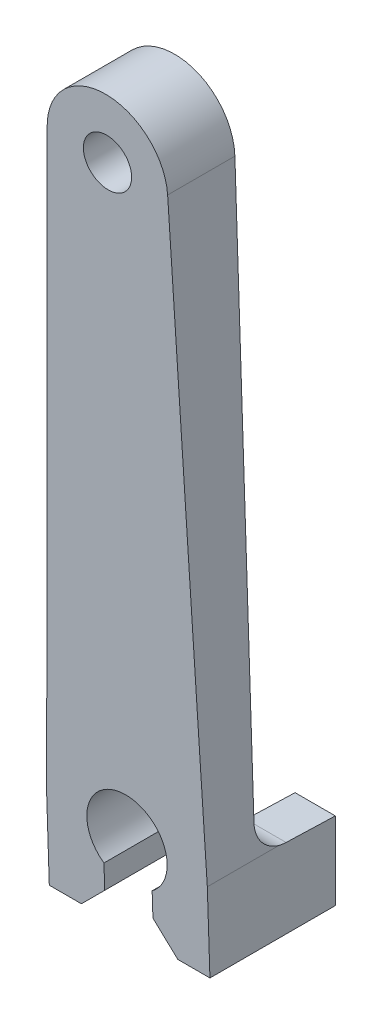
ISO-10303-21;
HEADER;
FILE_DESCRIPTION(('STEP AP214'),'2;1');
FILE_NAME('part.step','',(''),(''),'','','');
FILE_SCHEMA(('AUTOMOTIVE_DESIGN { 1 0 10303 214 1 1 1 1 }'));
ENDSEC;
DATA;
#1=APPLICATION_CONTEXT('core data for automotive mechanical design processes');
#2=APPLICATION_PROTOCOL_DEFINITION('international standard','automotive_design',2000,#1);
#3=PRODUCT_CONTEXT('',#1,'mechanical');
#4=PRODUCT('Part','Part','',(#3));
#5=PRODUCT_RELATED_PRODUCT_CATEGORY('part','',(#4));
#6=PRODUCT_DEFINITION_FORMATION('','',#4);
#7=PRODUCT_DEFINITION_CONTEXT('part definition',#1,'design');
#8=PRODUCT_DEFINITION('design','',#6,#7);
#9=PRODUCT_DEFINITION_SHAPE('','',#8);
#10=(LENGTH_UNIT() NAMED_UNIT(*) SI_UNIT(.MILLI.,.METRE.));
#11=(NAMED_UNIT(*) PLANE_ANGLE_UNIT() SI_UNIT($,.RADIAN.));
#12=(NAMED_UNIT(*) SI_UNIT($,.STERADIAN.) SOLID_ANGLE_UNIT());
#13=UNCERTAINTY_MEASURE_WITH_UNIT(LENGTH_MEASURE(1.E-05),#10,'distance_accuracy_value','');
#14=(GEOMETRIC_REPRESENTATION_CONTEXT(3) GLOBAL_UNCERTAINTY_ASSIGNED_CONTEXT((#13)) GLOBAL_UNIT_ASSIGNED_CONTEXT((#10,
#11,#12)) REPRESENTATION_CONTEXT('',''));
#15=CARTESIAN_POINT('',(0.,0.,0.));
#16=DIRECTION('',(0.,0.,1.));
#17=DIRECTION('',(1.,0.,0.));
#18=AXIS2_PLACEMENT_3D('',#15,#16,#17);
#19=CARTESIAN_POINT('',(0.,0.,0.));
#20=DIRECTION('',(0.,0.,1.));
#21=DIRECTION('',(1.,0.,0.));
#22=AXIS2_PLACEMENT_3D('',#19,#20,#21);
#23=PLANE('',#22);
#24=CARTESIAN_POINT('',(0.,0.,0.));
#25=DIRECTION('',(0.,0.,1.));
#26=DIRECTION('',(1.,0.,0.));
#27=AXIS2_PLACEMENT_3D('',#24,#25,#26);
#28=CIRCLE('',#27,3.);
#29=CARTESIAN_POINT('',(3.,0.,0.));
#30=VERTEX_POINT('',#29);
#31=EDGE_CURVE('E411',#30,#30,#28,.T.);
#32=ORIENTED_EDGE('',*,*,#31,.T.);
#33=EDGE_LOOP('',(#32));
#34=FACE_BOUND('',#33,.T.);
#35=DIRECTION('',(0.0335715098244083,-0.999436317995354,0.));
#36=VECTOR('',#35,1.);
#37=CARTESIAN_POINT('',(7.49577238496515,0.251786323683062,0.));
#38=LINE('',#37,#36);
#39=CARTESIAN_POINT('',(7.49577238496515,0.251786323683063,0.));
#40=VERTEX_POINT('',#39);
#41=CARTESIAN_POINT('',(9.86995344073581,-70.4284656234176,0.));
#42=VERTEX_POINT('',#41);
#43=EDGE_CURVE('E223',#40,#42,#38,.T.);
#44=ORIENTED_EDGE('',*,*,#43,.T.);
#45=DIRECTION('',(1.,0.,0.));
#46=VECTOR('',#45,1.);
#47=CARTESIAN_POINT('',(5.,-70.4284656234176,0.));
#48=LINE('',#47,#46);
#49=CARTESIAN_POINT('',(3.16405144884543,-70.4284656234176,0.));
#50=VERTEX_POINT('',#49);
#51=EDGE_CURVE('E233',#42,#50,#48,.F.);
#52=ORIENTED_EDGE('',*,*,#51,.T.);
#53=CARTESIAN_POINT('',(0.,-74.3,0.));
#54=DIRECTION('',(0.,0.,1.));
#55=DIRECTION('',(1.,0.,0.));
#56=AXIS2_PLACEMENT_3D('',#53,#54,#55);
#57=CIRCLE('',#56,5.);
#58=CARTESIAN_POINT('',(-3.16405144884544,-70.4284656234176,0.));
#59=VERTEX_POINT('',#58);
#60=EDGE_CURVE('E220',#50,#59,#57,.T.);
#61=ORIENTED_EDGE('',*,*,#60,.T.);
#62=DIRECTION('',(1.,0.,0.));
#63=VECTOR('',#62,1.);
#64=CARTESIAN_POINT('',(-10.,-70.4284656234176,0.));
#65=LINE('',#64,#63);
#66=CARTESIAN_POINT('',(-9.8699534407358,-70.4284656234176,0.));
#67=VERTEX_POINT('',#66);
#68=EDGE_CURVE('E231',#59,#67,#65,.F.);
#69=ORIENTED_EDGE('',*,*,#68,.T.);
#70=DIRECTION('',(-0.0335715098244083,-0.999436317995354,0.));
#71=VECTOR('',#70,1.);
#72=CARTESIAN_POINT('',(-7.49577238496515,0.251786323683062,0.));
#73=LINE('',#72,#71);
#74=CARTESIAN_POINT('',(-7.49577238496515,0.251786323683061,0.));
#75=VERTEX_POINT('',#74);
#76=EDGE_CURVE('E406',#75,#67,#73,.T.);
#77=ORIENTED_EDGE('',*,*,#76,.F.);
#78=CARTESIAN_POINT('',(0.,0.,0.));
#79=DIRECTION('',(0.,0.,1.));
#80=DIRECTION('',(1.,0.,0.));
#81=AXIS2_PLACEMENT_3D('',#78,#79,#80);
#82=CIRCLE('',#81,7.5);
#83=EDGE_CURVE('E412',#40,#75,#82,.T.);
#84=ORIENTED_EDGE('',*,*,#83,.F.);
#85=EDGE_LOOP('',(#44,#52,#61,#69,#77,#84));
#86=FACE_BOUND('',#85,.T.);
#87=ADVANCED_FACE('F34',(#34,#86),#23,.F.);
#88=CARTESIAN_POINT('',(0.,-74.3,8.61));
#89=DIRECTION('',(0.,0.,-1.));
#90=DIRECTION('',(-1.,0.,0.));
#91=AXIS2_PLACEMENT_3D('',#88,#89,#90);
#92=CYLINDRICAL_SURFACE('',#91,5.);
#93=CARTESIAN_POINT('',(0.,-74.3,3.08780778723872E-13));
#94=DIRECTION('',(0.,-0.9994674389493,0.0326318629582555));
#95=DIRECTION('',(0.,-0.0326318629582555,-0.9994674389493));
#96=AXIS2_PLACEMENT_3D('',#93,#94,#95);
#97=ELLIPSE('',#96,153.224472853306,5.);
#98=CARTESIAN_POINT('',(4.9893288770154,-74.626492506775,-10.));
#99=VERTEX_POINT('',#98);
#100=CARTESIAN_POINT('',(4.99840368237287,-74.4263353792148,-3.86947254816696));
#101=VERTEX_POINT('',#100);
#102=EDGE_CURVE('E238',#99,#101,#97,.T.);
#103=ORIENTED_EDGE('',*,*,#102,.F.);
#104=CARTESIAN_POINT('',(0.,-74.3,-10.));
#105=DIRECTION('',(0.,0.,1.));
#106=DIRECTION('',(-1.,0.,0.));
#107=AXIS2_PLACEMENT_3D('',#104,#105,#106);
#108=CIRCLE('',#107,5.);
#109=CARTESIAN_POINT('',(3.,-78.3,-10.));
#110=VERTEX_POINT('',#109);
#111=EDGE_CURVE('E254',#110,#99,#108,.T.);
#112=ORIENTED_EDGE('',*,*,#111,.F.);
#113=DIRECTION('',(0.,0.,-1.));
#114=VECTOR('',#113,1.);
#115=CARTESIAN_POINT('',(3.,-78.3,8.61));
#116=LINE('',#115,#114);
#117=CARTESIAN_POINT('',(3.,-78.3,5.80607843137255));
#118=VERTEX_POINT('',#117);
#119=EDGE_CURVE('E289',#118,#110,#116,.T.);
#120=ORIENTED_EDGE('',*,*,#119,.F.);
#121=CARTESIAN_POINT('',(0.,-74.3,5.93679738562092));
#122=DIRECTION('',(0.,-0.0326623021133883,0.999466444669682));
#123=DIRECTION('',(0.,-0.999466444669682,-0.0326623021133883));
#124=AXIS2_PLACEMENT_3D('',#121,#122,#123);
#125=ELLIPSE('',#124,5.00266920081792,5.);
#126=CARTESIAN_POINT('',(-3.,-78.3,5.80607843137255));
#127=VERTEX_POINT('',#126);
#128=EDGE_CURVE('E202',#118,#127,#125,.T.);
#129=ORIENTED_EDGE('',*,*,#128,.T.);
#130=DIRECTION('',(0.,0.,-1.));
#131=VECTOR('',#130,1.);
#132=CARTESIAN_POINT('',(-3.,-78.3,8.61));
#133=LINE('',#132,#131);
#134=CARTESIAN_POINT('',(-3.,-78.3,-10.));
#135=VERTEX_POINT('',#134);
#136=EDGE_CURVE('E415',#127,#135,#133,.T.);
#137=ORIENTED_EDGE('',*,*,#136,.T.);
#138=CARTESIAN_POINT('',(0.,-74.3,-10.));
#139=DIRECTION('',(0.,0.,1.));
#140=DIRECTION('',(-1.,0.,0.));
#141=AXIS2_PLACEMENT_3D('',#138,#139,#140);
#142=CIRCLE('',#141,5.);
#143=CARTESIAN_POINT('',(-4.9893288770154,-74.626492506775,-10.));
#144=VERTEX_POINT('',#143);
#145=EDGE_CURVE('E257',#144,#135,#142,.T.);
#146=ORIENTED_EDGE('',*,*,#145,.F.);
#147=CARTESIAN_POINT('',(-4.99840368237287,-74.4263353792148,-3.86947254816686));
#148=VERTEX_POINT('',#147);
#149=EDGE_CURVE('E170',#148,#144,#97,.T.);
#150=ORIENTED_EDGE('',*,*,#149,.F.);
#151=CARTESIAN_POINT('',(-4.99840368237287,-74.4263353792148,-3.86947254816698));
#152=CARTESIAN_POINT('',(-4.99846816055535,-74.4226998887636,-3.75776325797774));
#153=CARTESIAN_POINT('',(-4.99870159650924,-74.4143594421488,-3.64620977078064));
#154=CARTESIAN_POINT('',(-4.99924305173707,-74.3883789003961,-3.4241937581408));
#155=CARTESIAN_POINT('',(-4.99955106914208,-74.3707390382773,-3.31373120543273));
#156=CARTESIAN_POINT('',(-4.99997860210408,-74.326247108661,-3.09455927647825));
#157=CARTESIAN_POINT('',(-5.00009792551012,-74.2993856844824,-2.98585179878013));
#158=CARTESIAN_POINT('',(-4.99969748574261,-74.2366476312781,-2.77107187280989));
#159=CARTESIAN_POINT('',(-4.99917772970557,-74.2007711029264,-2.66499939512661));
#160=CARTESIAN_POINT('',(-4.99692942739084,-74.1202276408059,-2.45616465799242));
#161=CARTESIAN_POINT('',(-4.99519996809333,-74.0755540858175,-2.35340496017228));
#162=CARTESIAN_POINT('',(-4.98984498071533,-73.9777491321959,-2.15199485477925));
#163=CARTESIAN_POINT('',(-4.98621878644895,-73.9246147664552,-2.0533459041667));
#164=CARTESIAN_POINT('',(-4.97629817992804,-73.810367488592,-1.86101897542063));
#165=CARTESIAN_POINT('',(-4.9700058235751,-73.7492607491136,-1.76733722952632));
#166=CARTESIAN_POINT('',(-4.95391705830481,-73.6195793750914,-1.58561609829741));
#167=CARTESIAN_POINT('',(-4.94412100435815,-73.5510054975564,-1.49757614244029));
#168=CARTESIAN_POINT('',(-4.92049785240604,-73.4090862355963,-1.33024425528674));
#169=CARTESIAN_POINT('',(-4.90679151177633,-73.3359286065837,-1.25077622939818));
#170=CARTESIAN_POINT('',(-4.87448365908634,-73.1840098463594,-1.09852917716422));
#171=CARTESIAN_POINT('',(-4.85588445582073,-73.1052513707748,-1.0257470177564));
#172=CARTESIAN_POINT('',(-4.81308973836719,-72.9430946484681,-0.887446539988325));
#173=CARTESIAN_POINT('',(-4.78889760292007,-72.8596992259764,-0.821923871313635));
#174=CARTESIAN_POINT('',(-4.73431672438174,-72.6893355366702,-0.698557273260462));
#175=CARTESIAN_POINT('',(-4.70392865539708,-72.6023676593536,-0.64071250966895));
#176=CARTESIAN_POINT('',(-4.63983047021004,-72.4347332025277,-0.538269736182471));
#177=CARTESIAN_POINT('',(-4.60673679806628,-72.3542832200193,-0.492929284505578));
#178=CARTESIAN_POINT('',(-4.53498069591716,-72.1924463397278,-0.408804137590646));
#179=CARTESIAN_POINT('',(-4.49631846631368,-72.1110594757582,-0.370019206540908));
#180=CARTESIAN_POINT('',(-4.41337773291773,-71.9483113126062,-0.298924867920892));
#181=CARTESIAN_POINT('',(-4.36909858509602,-71.8669500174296,-0.266616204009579));
#182=CARTESIAN_POINT('',(-4.27501273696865,-71.7051936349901,-0.208251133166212));
#183=CARTESIAN_POINT('',(-4.2252060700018,-71.6247985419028,-0.182194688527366));
#184=CARTESIAN_POINT('',(-4.1217748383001,-71.4681226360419,-0.136636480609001));
#185=CARTESIAN_POINT('',(-4.06830189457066,-71.3917900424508,-0.11696728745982));
#186=CARTESIAN_POINT('',(-3.95655113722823,-71.2414911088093,-0.0827390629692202));
#187=CARTESIAN_POINT('',(-3.89827130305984,-71.1675257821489,-0.068182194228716));
#188=CARTESIAN_POINT('',(-3.77725912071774,-71.0226198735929,-0.0436913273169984));
#189=CARTESIAN_POINT('',(-3.71452946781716,-70.9516775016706,-0.0337545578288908));
#190=CARTESIAN_POINT('',(-3.58489626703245,-70.8132377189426,-0.0179396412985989));
#191=CARTESIAN_POINT('',(-3.51799261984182,-70.7457403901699,-0.0120615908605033));
#192=CARTESIAN_POINT('',(-3.40324797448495,-70.6364048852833,-0.00516776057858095));
#193=CARTESIAN_POINT('',(-3.35647042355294,-70.5935011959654,-0.00318493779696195));
#194=CARTESIAN_POINT('',(-3.26139806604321,-70.5095783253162,-0.000602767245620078));
#195=CARTESIAN_POINT('',(-3.2131067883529,-70.4685552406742,-4.13750689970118E-07));
#196=CARTESIAN_POINT('',(-3.16405144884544,-70.4284656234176,0.));
#197=B_SPLINE_CURVE_WITH_KNOTS('',3,(#151,#152,#153,#154,#155,#156,#157,#158,#159,#160,#161,
#162,#163,#164,#165,#166,#167,#168,#169,#170,#171,#172,#173,#174,#175,#176,#177,#178,#179,#180,
#181,#182,#183,#184,#185,#186,#187,#188,#189,#190,#191,#192,#193,#194,#195,#196),.UNSPECIFIED.,
.F.,.F.,(4,2,2,2,2,2,2,2,2,2,2,2,2,2,2,2,2,2,2,2,2,2,4),(0.,0.335203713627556,0.670399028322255,
1.0059354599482,1.34146814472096,1.67725434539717,2.01315856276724,2.34880423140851,
2.68441590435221,3.01061520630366,3.33666085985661,3.66251005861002,3.98832382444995,
4.28224169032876,4.57614898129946,4.87009000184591,5.16402924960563,5.44948749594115,
5.73506635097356,6.02047368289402,6.3058878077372,6.49634383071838,6.6863847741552),.UNSPECIFIED.);
#198=EDGE_CURVE('E319',#148,#59,#197,.T.);
#199=ORIENTED_EDGE('',*,*,#198,.T.);
#200=ORIENTED_EDGE('',*,*,#60,.F.);
#201=CARTESIAN_POINT('',(3.16405144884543,-70.4284656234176,0.));
#202=CARTESIAN_POINT('',(3.24727599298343,-70.4964618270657,1.80483169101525E-07));
#203=CARTESIAN_POINT('',(3.32831397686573,-70.5671851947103,-0.00173421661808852));
#204=CARTESIAN_POINT('',(3.4856284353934,-70.7136489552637,-0.00950453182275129));
#205=CARTESIAN_POINT('',(3.56190067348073,-70.7893936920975,-0.01554421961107));
#206=CARTESIAN_POINT('',(3.70949562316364,-70.9457103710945,-0.0328010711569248));
#207=CARTESIAN_POINT('',(3.78079324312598,-71.0263034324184,-0.0440425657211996));
#208=CARTESIAN_POINT('',(3.91755588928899,-71.1912659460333,-0.0725150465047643));
#209=CARTESIAN_POINT('',(3.98302258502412,-71.2756343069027,-0.0897443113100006));
#210=CARTESIAN_POINT('',(4.10813115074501,-71.4478674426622,-0.131058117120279));
#211=CARTESIAN_POINT('',(4.16773201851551,-71.5357515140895,-0.155186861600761));
#212=CARTESIAN_POINT('',(4.28026311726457,-71.7134188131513,-0.210863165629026));
#213=CARTESIAN_POINT('',(4.33319409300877,-71.8032018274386,-0.242409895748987));
#214=CARTESIAN_POINT('',(4.4320226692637,-71.9831742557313,-0.313239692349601));
#215=CARTESIAN_POINT('',(4.47794217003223,-72.0733614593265,-0.352497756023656));
#216=CARTESIAN_POINT('',(4.5629125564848,-72.2531217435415,-0.439020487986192));
#217=CARTESIAN_POINT('',(4.60196429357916,-72.3426948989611,-0.486284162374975));
#218=CARTESIAN_POINT('',(4.66951777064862,-72.5103429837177,-0.583257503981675));
#219=CARTESIAN_POINT('',(4.69870323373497,-72.5886155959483,-0.632152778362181));
#220=CARTESIAN_POINT('',(4.75201577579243,-72.7427592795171,-0.736154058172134));
#221=CARTESIAN_POINT('',(4.77614123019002,-72.8186295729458,-0.791262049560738));
#222=CARTESIAN_POINT('',(4.81970289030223,-72.9671608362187,-0.907440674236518));
#223=CARTESIAN_POINT('',(4.83913588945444,-73.039819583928,-0.968515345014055));
#224=CARTESIAN_POINT('',(4.87375703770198,-73.1811657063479,-1.09625726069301));
#225=CARTESIAN_POINT('',(4.88894352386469,-73.2498515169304,-1.16292668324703));
#226=CARTESIAN_POINT('',(4.91549926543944,-73.3821795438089,-1.3009896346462));
#227=CARTESIAN_POINT('',(4.92689167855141,-73.4458504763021,-1.37235119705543));
#228=CARTESIAN_POINT('',(4.94653189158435,-73.5681145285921,-1.51972013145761));
#229=CARTESIAN_POINT('',(4.95477857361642,-73.6267058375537,-1.59572914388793));
#230=CARTESIAN_POINT('',(4.97562120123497,-73.7941668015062,-1.83001676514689));
#231=CARTESIAN_POINT('',(4.98433512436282,-73.8948082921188,-1.99464433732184));
#232=CARTESIAN_POINT('',(4.99609939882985,-74.0798847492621,-2.35325688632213));
#233=CARTESIAN_POINT('',(4.99852226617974,-74.161819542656,-2.54854186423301));
#234=CARTESIAN_POINT('',(5.00043567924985,-74.2938200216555,-2.94953246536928));
#235=CARTESIAN_POINT('',(4.99992878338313,-74.3439134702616,-3.15522884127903));
#236=CARTESIAN_POINT('',(4.99918661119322,-74.3909943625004,-3.44718414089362));
#237=CARTESIAN_POINT('',(4.99896994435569,-74.4018302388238,-3.53139581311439));
#238=CARTESIAN_POINT('',(4.99861104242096,-74.4181116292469,-3.70018898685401));
#239=CARTESIAN_POINT('',(4.99846867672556,-74.4235666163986,-3.78476957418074));
#240=CARTESIAN_POINT('',(4.99840368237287,-74.4263353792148,-3.86947254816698));
#241=B_SPLINE_CURVE_WITH_KNOTS('',3,(#201,#202,#203,#204,#205,#206,#207,#208,#209,#210,#211,
#212,#213,#214,#215,#216,#217,#218,#219,#220,#221,#222,#223,#224,#225,#226,#227,#228,#229,#230,
#231,#232,#233,#234,#235,#236,#237,#238,#239,#240),.UNSPECIFIED.,.F.,.F.,(4,2,2,2,2,2,2,2,2,2,2,
2,2,2,2,2,2,2,2,4),(0.,0.322388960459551,0.64506054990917,0.969256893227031,1.29336011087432,
1.61958818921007,1.94577980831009,2.27093075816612,2.59604136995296,2.88606722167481,
3.17618604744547,3.46650256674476,3.75693261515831,4.04555602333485,4.33428190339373,
4.91136730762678,5.54412598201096,6.17633218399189,6.43091409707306,6.68504701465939),.UNSPECIFIED.);
#242=EDGE_CURVE('E317',#50,#101,#241,.T.);
#243=ORIENTED_EDGE('',*,*,#242,.T.);
#244=EDGE_LOOP('',(#103,#112,#120,#129,#137,#146,#150,#199,#200,#243));
#245=FACE_BOUND('',#244,.T.);
#246=ADVANCED_FACE('F315',(#245),#92,.F.);
#247=CARTESIAN_POINT('',(2.99999999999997,0.,8.61));
#248=DIRECTION('',(1.,0.,0.));
#249=DIRECTION('',(0.,1.,0.));
#250=AXIS2_PLACEMENT_3D('',#247,#248,#249);
#251=PLANE('',#250);
#252=DIRECTION('',(0.,-0.999466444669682,-0.0326623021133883));
#253=VECTOR('',#252,1.);
#254=CARTESIAN_POINT('',(2.99999999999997,0.00800119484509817,8.36516343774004));
#255=LINE('',#254,#253);
#256=CARTESIAN_POINT('',(3.,-81.3,5.70803921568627));
#257=VERTEX_POINT('',#256);
#258=EDGE_CURVE('E205',#118,#257,#255,.T.);
#259=ORIENTED_EDGE('',*,*,#258,.F.);
#260=ORIENTED_EDGE('',*,*,#119,.T.);
#261=DIRECTION('',(0.,1.,0.));
#262=VECTOR('',#261,1.);
#263=CARTESIAN_POINT('',(3.,-78.3,-10.));
#264=LINE('',#263,#262);
#265=CARTESIAN_POINT('',(3.,-81.3,-10.));
#266=VERTEX_POINT('',#265);
#267=EDGE_CURVE('E251',#266,#110,#264,.T.);
#268=ORIENTED_EDGE('',*,*,#267,.F.);
#269=DIRECTION('',(0.,0.,-1.));
#270=VECTOR('',#269,1.);
#271=CARTESIAN_POINT('',(3.,-81.3,8.61));
#272=LINE('',#271,#270);
#273=EDGE_CURVE('E287',#257,#266,#272,.T.);
#274=ORIENTED_EDGE('',*,*,#273,.F.);
#275=EDGE_LOOP('',(#259,#260,#268,#274));
#276=FACE_BOUND('',#275,.T.);
#277=ADVANCED_FACE('F336',(#276),#251,.F.);
#278=CARTESIAN_POINT('',(-39.15,-39.15,8.61));
#279=DIRECTION('',(0.707106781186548,0.707106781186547,0.));
#280=DIRECTION('',(-0.707106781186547,0.707106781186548,0.));
#281=AXIS2_PLACEMENT_3D('',#278,#279,#280);
#282=PLANE('',#281);
#283=DIRECTION('',(0.706918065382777,-0.706918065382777,-0.0231018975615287));
#284=VECTOR('',#283,1.);
#285=CARTESIAN_POINT('',(-39.1748969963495,-39.1251030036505,7.08630382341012));
#286=LINE('',#285,#284);
#287=CARTESIAN_POINT('',(6.,-84.3,5.61));
#288=VERTEX_POINT('',#287);
#289=EDGE_CURVE('E207',#257,#288,#286,.T.);
#290=ORIENTED_EDGE('',*,*,#289,.F.);
#291=ORIENTED_EDGE('',*,*,#273,.T.);
#292=DIRECTION('',(-0.707106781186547,0.707106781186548,0.));
#293=VECTOR('',#292,1.);
#294=CARTESIAN_POINT('',(3.,-81.3,-10.));
#295=LINE('',#294,#293);
#296=CARTESIAN_POINT('',(6.,-84.3,-10.));
#297=VERTEX_POINT('',#296);
#298=EDGE_CURVE('E248',#297,#266,#295,.T.);
#299=ORIENTED_EDGE('',*,*,#298,.F.);
#300=DIRECTION('',(0.,0.,-1.));
#301=VECTOR('',#300,1.);
#302=CARTESIAN_POINT('',(6.,-84.3,8.61));
#303=LINE('',#302,#301);
#304=EDGE_CURVE('E285',#288,#297,#303,.T.);
#305=ORIENTED_EDGE('',*,*,#304,.F.);
#306=EDGE_LOOP('',(#290,#291,#299,#305));
#307=FACE_BOUND('',#306,.T.);
#308=ADVANCED_FACE('F340',(#307),#282,.F.);
#309=CARTESIAN_POINT('',(0.,-84.3,8.61));
#310=DIRECTION('',(0.,1.,0.));
#311=DIRECTION('',(0.,0.,1.));
#312=AXIS2_PLACEMENT_3D('',#309,#310,#311);
#313=PLANE('',#312);
#314=DIRECTION('',(1.,0.,0.));
#315=VECTOR('',#314,1.);
#316=CARTESIAN_POINT('',(-19.805,-84.3,5.61));
#317=LINE('',#316,#315);
#318=CARTESIAN_POINT('',(10.,-84.3,5.61));
#319=VERTEX_POINT('',#318);
#320=EDGE_CURVE('E185',#288,#319,#317,.T.);
#321=ORIENTED_EDGE('',*,*,#320,.F.);
#322=ORIENTED_EDGE('',*,*,#304,.T.);
#323=DIRECTION('',(-1.,0.,0.));
#324=VECTOR('',#323,1.);
#325=CARTESIAN_POINT('',(6.,-84.3,-10.));
#326=LINE('',#325,#324);
#327=CARTESIAN_POINT('',(10.,-84.3,-10.));
#328=VERTEX_POINT('',#327);
#329=EDGE_CURVE('E245',#328,#297,#326,.T.);
#330=ORIENTED_EDGE('',*,*,#329,.F.);
#331=DIRECTION('',(0.,0.,-1.));
#332=VECTOR('',#331,1.);
#333=CARTESIAN_POINT('',(10.,-84.3,8.61));
#334=LINE('',#333,#332);
#335=EDGE_CURVE('E282',#319,#328,#334,.T.);
#336=ORIENTED_EDGE('',*,*,#335,.F.);
#337=EDGE_LOOP('',(#321,#322,#330,#336));
#338=FACE_BOUND('',#337,.T.);
#339=ADVANCED_FACE('F344',(#338),#313,.F.);
#340=CARTESIAN_POINT('',(9.99999999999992,0.,8.61));
#341=DIRECTION('',(1.,0.,0.));
#342=DIRECTION('',(0.,1.,0.));
#343=AXIS2_PLACEMENT_3D('',#340,#341,#342);
#344=PLANE('',#343);
#345=DIRECTION('',(0.,-0.0326318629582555,-0.9994674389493));
#346=VECTOR('',#345,1.);
#347=CARTESIAN_POINT('',(10.,-74.3,0.));
#348=LINE('',#347,#346);
#349=CARTESIAN_POINT('',(10.,-74.4263353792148,-3.86947254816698));
#350=VERTEX_POINT('',#349);
#351=CARTESIAN_POINT('',(10.,-74.626492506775,-10.));
#352=VERTEX_POINT('',#351);
#353=EDGE_CURVE('E178',#350,#352,#348,.T.);
#354=ORIENTED_EDGE('',*,*,#353,.F.);
#355=CARTESIAN_POINT('',(9.99999999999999,-70.4284656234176,-4.));
#356=DIRECTION('',(1.,0.,0.));
#357=DIRECTION('',(0.,1.,0.));
#358=AXIS2_PLACEMENT_3D('',#355,#356,#357);
#359=CIRCLE('',#358,4.);
#360=CARTESIAN_POINT('',(10.,-74.3,-2.99440486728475));
#361=VERTEX_POINT('',#360);
#362=EDGE_CURVE('E303',#350,#361,#359,.F.);
#363=ORIENTED_EDGE('',*,*,#362,.T.);
#364=DIRECTION('',(0.,0.,-1.));
#365=VECTOR('',#364,1.);
#366=CARTESIAN_POINT('',(10.,-74.3,8.61));
#367=LINE('',#366,#365);
#368=CARTESIAN_POINT('',(10.,-74.3,5.93679738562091));
#369=VERTEX_POINT('',#368);
#370=EDGE_CURVE('E57',#369,#361,#367,.T.);
#371=ORIENTED_EDGE('',*,*,#370,.F.);
#372=DIRECTION('',(0.,-0.999466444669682,-0.0326623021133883));
#373=VECTOR('',#372,1.);
#374=CARTESIAN_POINT('',(9.99999999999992,0.00800119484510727,8.36516343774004));
#375=LINE('',#374,#373);
#376=EDGE_CURVE('E217',#369,#319,#375,.T.);
#377=ORIENTED_EDGE('',*,*,#376,.T.);
#378=ORIENTED_EDGE('',*,*,#335,.T.);
#379=DIRECTION('',(0.,-1.,0.));
#380=VECTOR('',#379,1.);
#381=CARTESIAN_POINT('',(10.,-74.3,-10.));
#382=LINE('',#381,#380);
#383=EDGE_CURVE('E243',#352,#328,#382,.T.);
#384=ORIENTED_EDGE('',*,*,#383,.F.);
#385=EDGE_LOOP('',(#354,#363,#371,#377,#378,#384));
#386=FACE_BOUND('',#385,.T.);
#387=ADVANCED_FACE('F302',(#386),#344,.T.);
#388=CARTESIAN_POINT('',(7.49577238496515,0.251786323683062,8.61));
#389=DIRECTION('',(0.999436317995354,0.0335715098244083,0.));
#390=DIRECTION('',(-0.0335715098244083,0.999436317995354,0.));
#391=AXIS2_PLACEMENT_3D('',#388,#389,#390);
#392=PLANE('',#391);
#393=DIRECTION('',(0.,0.,-1.));
#394=VECTOR('',#393,1.);
#395=CARTESIAN_POINT('',(7.49577238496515,0.251786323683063,8.61));
#396=LINE('',#395,#394);
#397=CARTESIAN_POINT('',(7.49577238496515,0.251786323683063,8.37313027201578));
#398=VERTEX_POINT('',#397);
#399=EDGE_CURVE('E279',#398,#40,#396,.T.);
#400=ORIENTED_EDGE('',*,*,#399,.F.);
#401=DIRECTION('',(0.0335536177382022,-0.998903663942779,-0.0326439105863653));
#402=VECTOR('',#401,1.);
#403=CARTESIAN_POINT('',(7.49551293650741,0.259510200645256,8.3733826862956));
#404=LINE('',#403,#402);
#405=EDGE_CURVE('E215',#398,#369,#404,.T.);
#406=ORIENTED_EDGE('',*,*,#405,.T.);
#407=ORIENTED_EDGE('',*,*,#370,.T.);
#408=CARTESIAN_POINT('',(9.8699534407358,-70.4284656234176,-4.));
#409=DIRECTION('',(0.999436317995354,0.0335715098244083,0.));
#410=DIRECTION('',(-0.0335715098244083,0.999436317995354,0.));
#411=AXIS2_PLACEMENT_3D('',#408,#409,#410);
#412=ELLIPSE('',#411,4.00225599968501,4.);
#413=EDGE_CURVE('E320',#361,#42,#412,.F.);
#414=ORIENTED_EDGE('',*,*,#413,.T.);
#415=ORIENTED_EDGE('',*,*,#43,.F.);
#416=EDGE_LOOP('',(#400,#406,#407,#414,#415));
#417=FACE_BOUND('',#416,.T.);
#418=ADVANCED_FACE('F351',(#417),#392,.T.);
#419=CARTESIAN_POINT('',(0.,0.,8.61));
#420=DIRECTION('',(0.,0.,-1.));
#421=DIRECTION('',(-1.,0.,0.));
#422=AXIS2_PLACEMENT_3D('',#419,#420,#421);
#423=CYLINDRICAL_SURFACE('',#422,7.5);
#424=CARTESIAN_POINT('',(0.,0.,8.36490196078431));
#425=DIRECTION('',(0.,-0.0326623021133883,0.999466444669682));
#426=DIRECTION('',(0.,-0.999466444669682,-0.0326623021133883));
#427=AXIS2_PLACEMENT_3D('',#424,#425,#426);
#428=ELLIPSE('',#427,7.50400380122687,7.5);
#429=CARTESIAN_POINT('',(-7.49577238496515,0.251786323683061,8.37313027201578));
#430=VERTEX_POINT('',#429);
#431=EDGE_CURVE('E213',#398,#430,#428,.T.);
#432=ORIENTED_EDGE('',*,*,#431,.F.);
#433=ORIENTED_EDGE('',*,*,#399,.T.);
#434=ORIENTED_EDGE('',*,*,#83,.T.);
#435=DIRECTION('',(0.,0.,-1.));
#436=VECTOR('',#435,1.);
#437=CARTESIAN_POINT('',(-7.49577238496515,0.251786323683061,8.61));
#438=LINE('',#437,#436);
#439=EDGE_CURVE('E272',#430,#75,#438,.T.);
#440=ORIENTED_EDGE('',*,*,#439,.F.);
#441=EDGE_LOOP('',(#432,#433,#434,#440));
#442=FACE_BOUND('',#441,.T.);
#443=ADVANCED_FACE('F354',(#442),#423,.T.);
#444=CARTESIAN_POINT('',(-7.49577238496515,0.251786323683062,8.61));
#445=DIRECTION('',(0.999436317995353,-0.0335715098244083,0.));
#446=DIRECTION('',(0.0335715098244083,0.999436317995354,0.));
#447=AXIS2_PLACEMENT_3D('',#444,#445,#446);
#448=PLANE('',#447);
#449=DIRECTION('',(-0.0335536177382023,-0.998903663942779,-0.0326439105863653));
#450=VECTOR('',#449,1.);
#451=CARTESIAN_POINT('',(-7.4955129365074,0.259510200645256,8.3733826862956));
#452=LINE('',#451,#450);
#453=CARTESIAN_POINT('',(-10.,-74.3,5.93679738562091));
#454=VERTEX_POINT('',#453);
#455=EDGE_CURVE('E211',#430,#454,#452,.T.);
#456=ORIENTED_EDGE('',*,*,#455,.F.);
#457=ORIENTED_EDGE('',*,*,#439,.T.);
#458=ORIENTED_EDGE('',*,*,#76,.T.);
#459=CARTESIAN_POINT('',(-9.86995344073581,-70.4284656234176,-4.));
#460=DIRECTION('',(0.999436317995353,-0.0335715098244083,0.));
#461=DIRECTION('',(-0.0335715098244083,-0.999436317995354,0.));
#462=AXIS2_PLACEMENT_3D('',#459,#460,#461);
#463=ELLIPSE('',#462,4.00225599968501,4.);
#464=CARTESIAN_POINT('',(-10.,-74.3,-2.99440486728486));
#465=VERTEX_POINT('',#464);
#466=EDGE_CURVE('E43',#67,#465,#463,.T.);
#467=ORIENTED_EDGE('',*,*,#466,.T.);
#468=DIRECTION('',(0.,0.,-1.));
#469=VECTOR('',#468,1.);
#470=CARTESIAN_POINT('',(-10.,-74.3,8.61));
#471=LINE('',#470,#469);
#472=EDGE_CURVE('E49',#454,#465,#471,.T.);
#473=ORIENTED_EDGE('',*,*,#472,.F.);
#474=EDGE_LOOP('',(#456,#457,#458,#467,#473));
#475=FACE_BOUND('',#474,.T.);
#476=ADVANCED_FACE('F357',(#475),#448,.F.);
#477=CARTESIAN_POINT('',(-10.0000000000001,0.,8.61));
#478=DIRECTION('',(1.,0.,0.));
#479=DIRECTION('',(0.,1.,0.));
#480=AXIS2_PLACEMENT_3D('',#477,#478,#479);
#481=PLANE('',#480);
#482=ORIENTED_EDGE('',*,*,#472,.T.);
#483=CARTESIAN_POINT('',(-10.,-70.4284656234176,-4.));
#484=DIRECTION('',(1.,0.,0.));
#485=DIRECTION('',(0.,1.,0.));
#486=AXIS2_PLACEMENT_3D('',#483,#484,#485);
#487=CIRCLE('',#486,4.);
#488=CARTESIAN_POINT('',(-10.,-74.4263353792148,-3.86947254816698));
#489=VERTEX_POINT('',#488);
#490=EDGE_CURVE('E11',#465,#489,#487,.T.);
#491=ORIENTED_EDGE('',*,*,#490,.T.);
#492=DIRECTION('',(0.,-0.0326318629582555,-0.9994674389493));
#493=VECTOR('',#492,1.);
#494=CARTESIAN_POINT('',(-10.,-73.9400717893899,11.0240879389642));
#495=LINE('',#494,#493);
#496=CARTESIAN_POINT('',(-10.,-74.626492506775,-10.));
#497=VERTEX_POINT('',#496);
#498=EDGE_CURVE('E160',#489,#497,#495,.T.);
#499=ORIENTED_EDGE('',*,*,#498,.T.);
#500=DIRECTION('',(0.,1.,0.));
#501=VECTOR('',#500,1.);
#502=CARTESIAN_POINT('',(-10.,-74.3,-10.));
#503=LINE('',#502,#501);
#504=CARTESIAN_POINT('',(-9.99999999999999,-84.3,-10.));
#505=VERTEX_POINT('',#504);
#506=EDGE_CURVE('E165',#505,#497,#503,.T.);
#507=ORIENTED_EDGE('',*,*,#506,.F.);
#508=DIRECTION('',(0.,0.,-1.));
#509=VECTOR('',#508,1.);
#510=CARTESIAN_POINT('',(-9.99999999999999,-84.3,8.61));
#511=LINE('',#510,#509);
#512=CARTESIAN_POINT('',(-9.99999999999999,-84.3,5.61));
#513=VERTEX_POINT('',#512);
#514=EDGE_CURVE('E270',#513,#505,#511,.T.);
#515=ORIENTED_EDGE('',*,*,#514,.F.);
#516=DIRECTION('',(0.,-0.999466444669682,-0.0326623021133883));
#517=VECTOR('',#516,1.);
#518=CARTESIAN_POINT('',(-10.0000000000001,0.00800119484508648,8.36516343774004));
#519=LINE('',#518,#517);
#520=EDGE_CURVE('E209',#454,#513,#519,.T.);
#521=ORIENTED_EDGE('',*,*,#520,.F.);
#522=EDGE_LOOP('',(#482,#491,#499,#507,#515,#521));
#523=FACE_BOUND('',#522,.T.);
#524=ADVANCED_FACE('F162',(#523),#481,.F.);
#525=CARTESIAN_POINT('',(0.,-84.3,8.61));
#526=DIRECTION('',(0.,1.,0.));
#527=DIRECTION('',(0.,0.,1.));
#528=AXIS2_PLACEMENT_3D('',#525,#526,#527);
#529=PLANE('',#528);
#530=CARTESIAN_POINT('',(-5.99999999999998,-84.3,5.61));
#531=VERTEX_POINT('',#530);
#532=EDGE_CURVE('E187',#513,#531,#317,.T.);
#533=ORIENTED_EDGE('',*,*,#532,.F.);
#534=ORIENTED_EDGE('',*,*,#514,.T.);
#535=DIRECTION('',(-1.,0.,0.));
#536=VECTOR('',#535,1.);
#537=CARTESIAN_POINT('',(-9.99999999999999,-84.3,-10.));
#538=LINE('',#537,#536);
#539=CARTESIAN_POINT('',(-6.,-84.3,-10.));
#540=VERTEX_POINT('',#539);
#541=EDGE_CURVE('E184',#540,#505,#538,.T.);
#542=ORIENTED_EDGE('',*,*,#541,.F.);
#543=DIRECTION('',(0.,0.,-1.));
#544=VECTOR('',#543,1.);
#545=CARTESIAN_POINT('',(-6.,-84.3,8.61));
#546=LINE('',#545,#544);
#547=EDGE_CURVE('E269',#531,#540,#546,.T.);
#548=ORIENTED_EDGE('',*,*,#547,.F.);
#549=EDGE_LOOP('',(#533,#534,#542,#548));
#550=FACE_BOUND('',#549,.T.);
#551=ADVANCED_FACE('F268',(#550),#529,.F.);
#552=CARTESIAN_POINT('',(39.15,-39.15,8.61));
#553=DIRECTION('',(0.707106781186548,-0.707106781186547,0.));
#554=DIRECTION('',(0.707106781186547,0.707106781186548,0.));
#555=AXIS2_PLACEMENT_3D('',#552,#553,#554);
#556=PLANE('',#555);
#557=DIRECTION('',(0.,0.,-1.));
#558=VECTOR('',#557,1.);
#559=CARTESIAN_POINT('',(-3.,-81.3,8.61));
#560=LINE('',#559,#558);
#561=CARTESIAN_POINT('',(-3.,-81.3,5.70803921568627));
#562=VERTEX_POINT('',#561);
#563=CARTESIAN_POINT('',(-3.,-81.3,-10.));
#564=VERTEX_POINT('',#563);
#565=EDGE_CURVE('E274',#562,#564,#560,.T.);
#566=ORIENTED_EDGE('',*,*,#565,.F.);
#567=DIRECTION('',(-0.706918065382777,-0.706918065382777,-0.0231018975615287));
#568=VECTOR('',#567,1.);
#569=CARTESIAN_POINT('',(39.1748969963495,-39.1251030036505,7.08630382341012));
#570=LINE('',#569,#568);
#571=EDGE_CURVE('E199',#562,#531,#570,.T.);
#572=ORIENTED_EDGE('',*,*,#571,.T.);
#573=ORIENTED_EDGE('',*,*,#547,.T.);
#574=DIRECTION('',(-0.707106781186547,-0.707106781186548,0.));
#575=VECTOR('',#574,1.);
#576=CARTESIAN_POINT('',(-3.,-81.3,-10.));
#577=LINE('',#576,#575);
#578=EDGE_CURVE('E189',#564,#540,#577,.T.);
#579=ORIENTED_EDGE('',*,*,#578,.F.);
#580=EDGE_LOOP('',(#566,#572,#573,#579));
#581=FACE_BOUND('',#580,.T.);
#582=ADVANCED_FACE('F366',(#581),#556,.T.);
#583=CARTESIAN_POINT('',(-2.99999999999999,0.,8.61));
#584=DIRECTION('',(1.,0.,0.));
#585=DIRECTION('',(0.,1.,0.));
#586=AXIS2_PLACEMENT_3D('',#583,#584,#585);
#587=PLANE('',#586);
#588=ORIENTED_EDGE('',*,*,#136,.F.);
#589=DIRECTION('',(0.,-0.999466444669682,-0.0326623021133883));
#590=VECTOR('',#589,1.);
#591=CARTESIAN_POINT('',(-2.99999999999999,0.0080011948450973,8.36516343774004));
#592=LINE('',#591,#590);
#593=EDGE_CURVE('E196',#127,#562,#592,.T.);
#594=ORIENTED_EDGE('',*,*,#593,.T.);
#595=ORIENTED_EDGE('',*,*,#565,.T.);
#596=DIRECTION('',(0.,-1.,0.));
#597=VECTOR('',#596,1.);
#598=CARTESIAN_POINT('',(-3.,-78.3,-10.));
#599=LINE('',#598,#597);
#600=EDGE_CURVE('E259',#135,#564,#599,.T.);
#601=ORIENTED_EDGE('',*,*,#600,.F.);
#602=EDGE_LOOP('',(#588,#594,#595,#601));
#603=FACE_BOUND('',#602,.T.);
#604=ADVANCED_FACE('F369',(#603),#587,.T.);
#605=CARTESIAN_POINT('',(0.,0.,8.61));
#606=DIRECTION('',(0.,0.,-1.));
#607=DIRECTION('',(-1.,0.,0.));
#608=AXIS2_PLACEMENT_3D('',#605,#606,#607);
#609=CYLINDRICAL_SURFACE('',#608,3.);
#610=ORIENTED_EDGE('',*,*,#31,.F.);
#611=EDGE_LOOP('',(#610));
#612=FACE_BOUND('',#611,.T.);
#613=CARTESIAN_POINT('',(0.,0.,8.36490196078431));
#614=DIRECTION('',(0.,-0.0326623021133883,0.999466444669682));
#615=DIRECTION('',(0.,-0.999466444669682,-0.0326623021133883));
#616=AXIS2_PLACEMENT_3D('',#613,#614,#615);
#617=ELLIPSE('',#616,3.00160152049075,3.);
#618=CARTESIAN_POINT('',(0.,-3.,8.26686274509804));
#619=VERTEX_POINT('',#618);
#620=EDGE_CURVE('E193',#619,#619,#617,.T.);
#621=ORIENTED_EDGE('',*,*,#620,.T.);
#622=EDGE_LOOP('',(#621));
#623=FACE_BOUND('',#622,.T.);
#624=ADVANCED_FACE('F372',(#612,#623),#609,.F.);
#625=CARTESIAN_POINT('',(-19.805,-0.273071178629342,8.35597806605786));
#626=DIRECTION('',(0.,-0.0326623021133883,0.999466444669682));
#627=DIRECTION('',(0.,-0.999466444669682,-0.0326623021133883));
#628=AXIS2_PLACEMENT_3D('',#625,#626,#627);
#629=PLANE('',#628);
#630=ORIENTED_EDGE('',*,*,#620,.F.);
#631=EDGE_LOOP('',(#630));
#632=FACE_BOUND('',#631,.T.);
#633=ORIENTED_EDGE('',*,*,#405,.F.);
#634=ORIENTED_EDGE('',*,*,#431,.T.);
#635=ORIENTED_EDGE('',*,*,#455,.T.);
#636=ORIENTED_EDGE('',*,*,#520,.T.);
#637=ORIENTED_EDGE('',*,*,#532,.T.);
#638=ORIENTED_EDGE('',*,*,#571,.F.);
#639=ORIENTED_EDGE('',*,*,#593,.F.);
#640=ORIENTED_EDGE('',*,*,#128,.F.);
#641=ORIENTED_EDGE('',*,*,#258,.T.);
#642=ORIENTED_EDGE('',*,*,#289,.T.);
#643=ORIENTED_EDGE('',*,*,#320,.T.);
#644=ORIENTED_EDGE('',*,*,#376,.F.);
#645=EDGE_LOOP('',(#633,#634,#635,#636,#637,#638,#639,#640,#641,#642,#643,#644));
#646=FACE_BOUND('',#645,.T.);
#647=ADVANCED_FACE('F376',(#632,#646),#629,.T.);
#648=CARTESIAN_POINT('',(0.,-74.3,-10.));
#649=DIRECTION('',(0.,0.,-1.));
#650=DIRECTION('',(-1.,0.,0.));
#651=AXIS2_PLACEMENT_3D('',#648,#649,#650);
#652=PLANE('',#651);
#653=DIRECTION('',(1.,0.,0.));
#654=VECTOR('',#653,1.);
#655=CARTESIAN_POINT('',(-17.,-74.626492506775,-10.));
#656=LINE('',#655,#654);
#657=EDGE_CURVE('E171',#497,#144,#656,.T.);
#658=ORIENTED_EDGE('',*,*,#657,.T.);
#659=ORIENTED_EDGE('',*,*,#145,.T.);
#660=ORIENTED_EDGE('',*,*,#600,.T.);
#661=ORIENTED_EDGE('',*,*,#578,.T.);
#662=ORIENTED_EDGE('',*,*,#541,.T.);
#663=ORIENTED_EDGE('',*,*,#506,.T.);
#664=EDGE_LOOP('',(#658,#659,#660,#661,#662,#663));
#665=FACE_BOUND('',#664,.T.);
#666=ADVANCED_FACE('F181',(#665),#652,.T.);
#667=CARTESIAN_POINT('',(0.,-74.3,-10.));
#668=DIRECTION('',(0.,0.,-1.));
#669=DIRECTION('',(-1.,0.,0.));
#670=AXIS2_PLACEMENT_3D('',#667,#668,#669);
#671=PLANE('',#670);
#672=DIRECTION('',(-1.,0.,0.));
#673=VECTOR('',#672,1.);
#674=CARTESIAN_POINT('',(0.,-74.626492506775,-10.));
#675=LINE('',#674,#673);
#676=EDGE_CURVE('E290',#352,#99,#675,.T.);
#677=ORIENTED_EDGE('',*,*,#676,.F.);
#678=ORIENTED_EDGE('',*,*,#383,.T.);
#679=ORIENTED_EDGE('',*,*,#329,.T.);
#680=ORIENTED_EDGE('',*,*,#298,.T.);
#681=ORIENTED_EDGE('',*,*,#267,.T.);
#682=ORIENTED_EDGE('',*,*,#111,.T.);
#683=EDGE_LOOP('',(#677,#678,#679,#680,#681,#682));
#684=FACE_BOUND('',#683,.T.);
#685=ADVANCED_FACE('F309',(#684),#671,.T.);
#686=CARTESIAN_POINT('',(-17.,-74.3,0.));
#687=DIRECTION('',(0.,-0.9994674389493,0.0326318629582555));
#688=DIRECTION('',(0.,-0.0326318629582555,-0.9994674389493));
#689=AXIS2_PLACEMENT_3D('',#686,#687,#688);
#690=PLANE('',#689);
#691=ORIENTED_EDGE('',*,*,#102,.T.);
#692=DIRECTION('',(1.,0.,0.));
#693=VECTOR('',#692,1.);
#694=CARTESIAN_POINT('',(10.,-74.4263353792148,-3.86947254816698));
#695=LINE('',#694,#693);
#696=EDGE_CURVE('E229',#101,#350,#695,.T.);
#697=ORIENTED_EDGE('',*,*,#696,.T.);
#698=ORIENTED_EDGE('',*,*,#353,.T.);
#699=ORIENTED_EDGE('',*,*,#676,.T.);
#700=EDGE_LOOP('',(#691,#697,#698,#699));
#701=FACE_BOUND('',#700,.T.);
#702=ADVANCED_FACE('F297',(#701),#690,.F.);
#703=ORIENTED_EDGE('',*,*,#498,.F.);
#704=DIRECTION('',(1.,0.,0.));
#705=VECTOR('',#704,1.);
#706=CARTESIAN_POINT('',(-5.,-74.4263353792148,-3.86947254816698));
#707=LINE('',#706,#705);
#708=EDGE_CURVE('E235',#489,#148,#707,.T.);
#709=ORIENTED_EDGE('',*,*,#708,.T.);
#710=ORIENTED_EDGE('',*,*,#149,.T.);
#711=ORIENTED_EDGE('',*,*,#657,.F.);
#712=EDGE_LOOP('',(#703,#709,#710,#711));
#713=FACE_BOUND('',#712,.T.);
#714=ADVANCED_FACE('F174',(#713),#690,.F.);
#715=CARTESIAN_POINT('',(-17.,-70.4284656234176,-4.));
#716=DIRECTION('',(-1.,0.,0.));
#717=DIRECTION('',(0.,-1.,0.));
#718=AXIS2_PLACEMENT_3D('',#715,#716,#717);
#719=CYLINDRICAL_SURFACE('',#718,4.);
#720=ORIENTED_EDGE('',*,*,#242,.F.);
#721=ORIENTED_EDGE('',*,*,#51,.F.);
#722=ORIENTED_EDGE('',*,*,#413,.F.);
#723=ORIENTED_EDGE('',*,*,#362,.F.);
#724=ORIENTED_EDGE('',*,*,#696,.F.);
#725=EDGE_LOOP('',(#720,#721,#722,#723,#724));
#726=FACE_BOUND('',#725,.T.);
#727=ADVANCED_FACE('F331',(#726),#719,.F.);
#728=CARTESIAN_POINT('',(-17.,-70.4284656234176,-4.));
#729=DIRECTION('',(-1.,0.,0.));
#730=DIRECTION('',(0.,-1.,0.));
#731=AXIS2_PLACEMENT_3D('',#728,#729,#730);
#732=CYLINDRICAL_SURFACE('',#731,4.);
#733=ORIENTED_EDGE('',*,*,#466,.F.);
#734=ORIENTED_EDGE('',*,*,#68,.F.);
#735=ORIENTED_EDGE('',*,*,#198,.F.);
#736=ORIENTED_EDGE('',*,*,#708,.F.);
#737=ORIENTED_EDGE('',*,*,#490,.F.);
#738=EDGE_LOOP('',(#733,#734,#735,#736,#737));
#739=FACE_BOUND('',#738,.T.);
#740=ADVANCED_FACE('F36',(#739),#732,.F.);
#741=CLOSED_SHELL('',(#87,#246,#277,#308,#339,#387,#418,#443,#476,#524,#551,#582,#604,#624,#647,
#666,#685,#702,#714,#727,#740));
#742=MANIFOLD_SOLID_BREP('B2',#741);
#743=ADVANCED_BREP_SHAPE_REPRESENTATION('',(#18,#742),#14);
#744=SHAPE_DEFINITION_REPRESENTATION(#9,#743);
ENDSEC;
END-ISO-10303-21;
